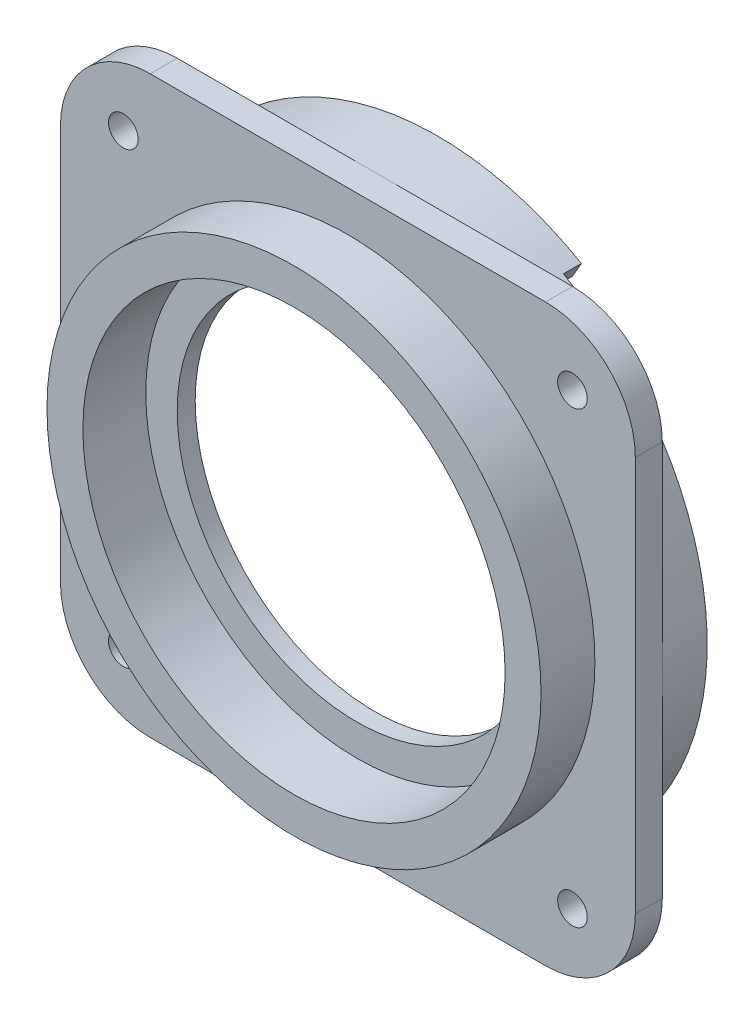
from build123d import *

# Parameters (mm, degrees)
SKETCH_1_R             = 32
SKETCH_1_R_2           = 30
EXTRUDE_1_DEPTH        = 6
SKETCH_2_R             = 32
SKETCH_2_R_2           = 20
EXTRUDE_2_DEPTH        = 2
EXTRUDE_START          = -10
EXTRUDE_3_DEPTH        = 3
SKETCH_4_R             = 1.65
CUT_EXTRUDE_1_DEPTH    = 47.346520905
FILLET_2_R             = 10
SKETCH_7_R             = 30
SKETCH_7_R_2           = 20
EXTRUDE_4_DEPTH        = 3
SKETCH_8_R             = 23.5
CUT_EXTRUDE_4_DEPTH    = 3
EXTRUDE_START_2        = 4
SKETCH_9_R             = 32
SKETCH_9_R_2           = 23.5
EXTRUDE_5_DEPTH        = 4
HOLE_WIZARD_M4_1_D     = 3.3
HOLE_WIZARD_M4_1_DEPTH = 10.1
HOLE_WIZARD_M4_1_TIP   = 0.991420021
CUT_EXTRUDE_START      = -2
CUT_EXTRUDE_7_DEPTH    = 2
SKETCH_14_R            = 32
SKETCH_14_R_2          = 27.5
CUT_EXTRUDE_8_DEPTH    = 6


with BuildPart() as part:
    # Sketch 1 → Extrude 1 (new, symmetric)
    with BuildSketch(Plane.XY):
        Circle(SKETCH_1_R)
        Circle(SKETCH_1_R_2, mode=Mode.SUBTRACT)
    extrude(amount=EXTRUDE_1_DEPTH, both=True)

    # Sketch 2 → Extrude 2 (add)
    with BuildSketch(Plane.XY.offset(6)):
        Circle(SKETCH_2_R)
        Circle(SKETCH_2_R_2, mode=Mode.SUBTRACT)
    extrude(amount=-EXTRUDE_2_DEPTH)

    # Sketch 3 → Extrude 3 (add)
    with BuildSketch(Plane(origin=(0, 0, -6), x_dir=(-1, 0, 0), z_dir=(0, 0, -1)).offset(EXTRUDE_START)):
        with BuildLine():
            Line((-32, 0), (-32, -32))
            Line((-32, -32), (4.8e-08, -32))
            ThreePointArc((4.8e-08, -32), (-22.627416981, -22.627417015), (-32, 0))
        make_face()
        with BuildLine():
            Line((-32, 32), (-32, 0))
            ThreePointArc((-32, 0), (-22.627417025, 22.627416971), (-7.7e-08, 32))
            Line((-7.7e-08, 32), (-32, 32))
        make_face()
        with BuildLine():
            ThreePointArc((-7.7e-08, 32), (22.627416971, 22.627417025), (32, 0))
            Line((32, 0), (32, 32))
            Line((32, 32), (-7.7e-08, 32))
        make_face()
        with BuildLine():
            ThreePointArc((32, 0), (22.627417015, -22.627416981), (4.8e-08, -32))
            Line((4.8e-08, -32), (32, -32))
            Line((32, -32), (32, 0))
        make_face()
    extrude(amount=EXTRUDE_3_DEPTH)

    # Sketch 4 → Cut-Extrude 1 (cut, through all)
    with BuildSketch(Plane.XY.offset(4)):
        with Locations((-25, 25)):
            Circle(SKETCH_4_R)
        with Locations((25, 25)):
            Circle(SKETCH_4_R)
        with Locations((25, -25)):
            Circle(SKETCH_4_R)
        with Locations((-25, -25)):
            Circle(SKETCH_4_R)
    extrude(amount=-CUT_EXTRUDE_1_DEPTH, mode=Mode.SUBTRACT)

    # Fillet 2
    fillet_2_edges = [part.edges().sort_by_distance(p)[0] for p in [
        (32, -32, 2.5),
        (32, 32, 2.5),
        (-32, 32, 2.5),
        (-32, -32, 2.5),
    ]]
    fillet(fillet_2_edges, radius=FILLET_2_R)

    # Sketch 7 → Extrude 4 (add)
    with BuildSketch(Plane(origin=(0, 0, 4), x_dir=(-1, 0, 0), z_dir=(0, 0, -1))):
        Circle(SKETCH_7_R)
        with Locations(Location((0, 0, 0), (0, 0, 180))):
            Circle(SKETCH_7_R_2, mode=Mode.SUBTRACT)
    extrude(amount=EXTRUDE_4_DEPTH)

    # Sketch 8 → Cut-Extrude 4 (cut)
    with BuildSketch(Plane.XY.offset(6)):
        Circle(SKETCH_8_R)
    extrude(amount=-CUT_EXTRUDE_4_DEPTH, mode=Mode.SUBTRACT)

    # Sketch 9 → Extrude 5 (add)
    with BuildSketch(Plane.XY.offset(6).offset(EXTRUDE_START_2)):
        Circle(SKETCH_9_R)
        Circle(SKETCH_9_R_2, mode=Mode.SUBTRACT)
    extrude(amount=-EXTRUDE_5_DEPTH)

    # Hole Wizard M4 _1
    with Locations(Plane(origin=(-25, -25, 4), x_dir=(1, 0, 0), z_dir=(0, 0, 1))):
        with Locations((0, 0), (50, 0), (50, 50), (0, 50)):
            Hole(HOLE_WIZARD_M4_1_D / 2, depth=HOLE_WIZARD_M4_1_DEPTH)
            with Locations((0, 0, -(HOLE_WIZARD_M4_1_DEPTH + HOLE_WIZARD_M4_1_TIP / 2))):  # 118° drill point
                Cone(0, HOLE_WIZARD_M4_1_D / 2, HOLE_WIZARD_M4_1_TIP, mode=Mode.SUBTRACT)

    # Sketch 13 → Cut-Extrude 7 (cut)
    with BuildSketch(Plane(origin=(0, 0, -6), x_dir=(-1, 0, 0), z_dir=(0, 0, -1)).offset(CUT_EXTRUDE_START)):
        with BuildLine():
            Line((-16, 27.712812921), (-15, 25.980762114))
            ThreePointArc((-15, 25.980762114), (-30, 0), (-15, -25.980762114))
            Line((-15, -25.980762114), (-16, -27.712812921))
            ThreePointArc((-16, -27.712812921), (-32, 0), (-16, 27.712812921))
        make_face()
    extrude(amount=CUT_EXTRUDE_7_DEPTH, mode=Mode.SUBTRACT)

    # Sketch 14 → Cut-Extrude 8 (cut)
    with BuildSketch(Plane.XY.offset(10)):
        with Locations(Location((0, 0, 0), (0, 0, 180))):
            Circle(SKETCH_14_R)
        Circle(SKETCH_14_R_2, mode=Mode.SUBTRACT)
    extrude(amount=-CUT_EXTRUDE_8_DEPTH, mode=Mode.SUBTRACT)


solid = part.part
